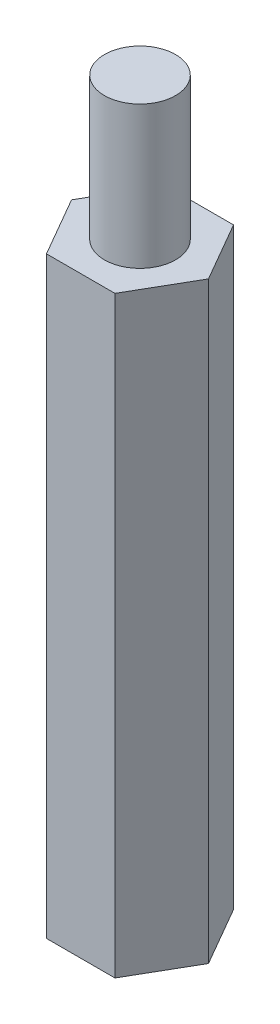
from build123d import *

# Parameters (mm, degrees)
SKETCH_1_R      = 1.5
EXTRUDE_1_DEPTH = 25
SKETCH_2_R      = 1.5
EXTRUDE_2_DEPTH = 6


with BuildPart() as part:
    # Sketch 1 → Extrude 1 (new body)
    with BuildSketch(Plane(origin=(0, 0, 0), x_dir=(1, 0, 0), z_dir=(0, 1, 0))):
        Polygon((2.886751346, 0), (1.443375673, 2.5), (-1.443375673, 2.5), (-2.886751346, 0), (-1.443375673, -2.5), (1.443375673, -2.5), align=None)
        with Locations(Location((0, 0, 0), (0, 0, 270))):
            Circle(SKETCH_1_R, mode=Mode.SUBTRACT)
    extrude(amount=EXTRUDE_1_DEPTH)


with BuildPart() as body_2:
    # Sketch 2 → Extrude 2 (new body)
    with BuildSketch(Plane(origin=(0, 25, 0), x_dir=(1, 0, 0), z_dir=(0, 1, 0))):
        with Locations(Location((0, 0, 0), (0, 0, 270))):
            Circle(SKETCH_2_R)
    extrude(amount=EXTRUDE_2_DEPTH)


solid = Compound([part.part, body_2.part])
